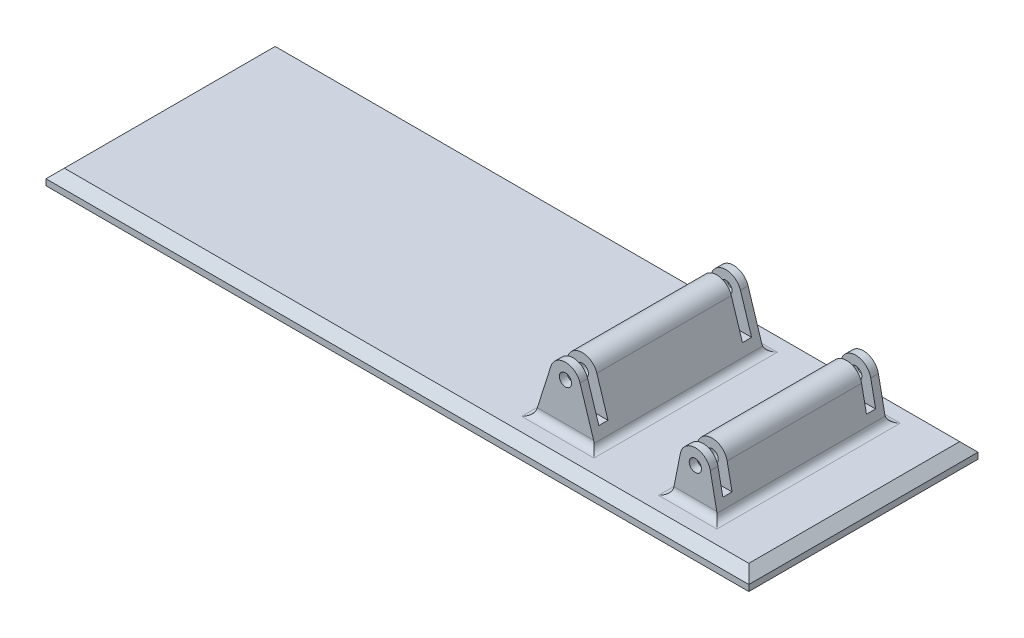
from build123d import *

# Parameters (mm, degrees)
SKETCH1_W                = 584.2
SKETCH1_H                = 190.5
SKETCH1_W_2              = 50.8
SKETCH1_H_2              = 139.7
SKETCH1_W_3              = 38.1
BASE_DEPTH               = 12.7
EDGE_CHAMFER_SIZE        = 7.62
MOUNTING_BOSS_DEPTH      = 69.85
MOUNTING_BOSS_DEPTH_BACK = 69.85
SKETCH2_R                = 12.7
MOUNTING_FILLET_R        = 6.35
SKETCH3_W                = 7.62
SKETCH3_H                = 38.1
SUPPORT_CUT_DEPTH        = 312.409075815
PIN_CUT_DEPTH            = 312.409075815
PIN_CUT_DEPTH_BACK       = 312.409075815
SKETCH4_R                = 5.08


with BuildPart() as part:
    # Sketch1 → Base (new body)
    # profile 1 of 3: a face of its own
    with BuildSketch(Plane(origin=(0, 0, 0), x_dir=(1, 0, 0), z_dir=(0, 1, 0))):
        Rectangle(SKETCH1_W, SKETCH1_H)
        with Locations((114.3, 0)):
            Rectangle(SKETCH1_W_2, SKETCH1_H_2, mode=Mode.SUBTRACT)
    # profile 2 of 3: a face of its own
    with BuildSketch(Plane(origin=(0, 0, 0), x_dir=(1, 0, 0), z_dir=(0, 1, 0))):
        with Locations((114.3, 0)):
            Rectangle(SKETCH1_W_2, SKETCH1_H_2)
    # profile 3 of 3: a face of its own
    with BuildSketch(Plane(origin=(0, 0, 0), x_dir=(1, 0, 0), z_dir=(0, 1, 0))):
        with Locations((222.25, 0)):
            Rectangle(SKETCH1_W_3, SKETCH1_H_2)
    extrude(amount=-BASE_DEPTH)

    # Edge Chamfer
    edge_chamfer_edges = [part.edges().sort_by_distance(p)[0] for p in [
        (-292.1, 0, 0),
        (0, 0, -95.25),
        (292.1, 0, 0),
        (0, 0, 95.25),
    ]]
    chamfer(edge_chamfer_edges, length=EDGE_CHAMFER_SIZE)

    # Sketch2 → Mounting Boss (add, two sides: drawn at the far end of the back side and taken through both)
    with BuildSketch(Plane.XY.offset(-MOUNTING_BOSS_DEPTH_BACK)):
        with BuildLine():
            Line((114.3, 0), (114.3, 25.4))
            ThreePointArc((114.3, 25.4), (104.052392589, 30.598230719), (102.19367142, 41.937552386))
            Line((102.19367142, 41.937552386), (88.9, 0))
            Line((88.9, 0), (114.3, 0))
        make_face()
        with BuildLine():
            ThreePointArc((127, 38.1), (123.280256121, 29.119743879), (114.3, 25.4))
            Line((114.3, 25.4), (114.3, 0))
            Line((114.3, 0), (139.7, 0))
            Line((139.7, 0), (126.40632858, 41.937552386))
            ThreePointArc((126.40632858, 41.937552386), (126.850704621, 40.041600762), (127, 38.1))
        make_face()
        with BuildLine():
            ThreePointArc((126.40632858, 41.937552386), (121.801769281, 48.347607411), (114.3, 50.8))
            Line((114.3, 50.8), (114.3, 25.4))
            ThreePointArc((114.3, 25.4), (123.280256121, 29.119743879), (127, 38.1))
            ThreePointArc((127, 38.1), (126.850704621, 40.041600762), (126.40632858, 41.937552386))
        make_face()
        with BuildLine():
            Line((114.3, 25.4), (114.3, 50.8))
            ThreePointArc((114.3, 50.8), (106.798230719, 48.347607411), (102.19367142, 41.937552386))
            ThreePointArc((102.19367142, 41.937552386), (104.052392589, 30.598230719), (114.3, 25.4))
        make_face()
        with BuildLine():
            ThreePointArc((126.40632858, 41.937552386), (121.801769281, 48.347607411), (114.3, 50.8))
            Line((114.3, 50.8), (114.3, 25.4))
            ThreePointArc((114.3, 25.4), (123.280256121, 29.119743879), (127, 38.1))
            ThreePointArc((127, 38.1), (126.850704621, 40.041600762), (126.40632858, 41.937552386))
        make_face()
        with BuildLine():
            Line((114.3, 25.4), (114.3, 50.8))
            ThreePointArc((114.3, 50.8), (106.798230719, 48.347607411), (102.19367142, 41.937552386))
            ThreePointArc((102.19367142, 41.937552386), (104.052392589, 30.598230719), (114.3, 25.4))
        make_face()
        with BuildLine():
            ThreePointArc((234.95, 30.48), (220.998113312, 17.841852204), (209.796806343, 32.971579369))
            Line((209.796806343, 32.971579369), (203.2, 0))
            Line((203.2, 0), (241.3, 0))
            Line((241.3, 0), (234.703193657, 32.971579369))
            ThreePointArc((234.703193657, 32.971579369), (234.888147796, 31.731886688), (234.95, 30.48))
        make_face()
        with Locations((222.25, 30.48)):
            Circle(SKETCH2_R)
    extrude(amount=MOUNTING_BOSS_DEPTH + MOUNTING_BOSS_DEPTH_BACK)

    # Mounting Fillet
    mounting_fillet_edges = [part.edges().sort_by_distance(p)[0] for p in [
        (139.7, 0, 0),
        (114.3, 0, -69.85),
        (88.9, 0, 0),
        (114.3, 0, 69.85),
        (241.3, 0, 0),
        (222.25, 0, -69.85),
        (203.2, 0, 0),
        (222.25, 0, 69.85),
    ]]
    fillet(mounting_fillet_edges, radius=MOUNTING_FILLET_R)

    # Sketch3 → Support Cut (cut, through all)
    with BuildSketch(Plane(origin=(0, 0, 0), x_dir=(0, 0, -1), z_dir=(1, 0, 0))):
        with Locations((-59.69, 31.75)):
            Rectangle(SKETCH3_W, SKETCH3_H)
        with Locations((59.69, 31.75)):
            Rectangle(SKETCH3_W, SKETCH3_H)
    extrude(amount=SUPPORT_CUT_DEPTH, mode=Mode.SUBTRACT)

    # Sketch4 → Pin Cut (cut, two sides: drawn at the far end of the back side and taken through both)
    with BuildSketch(Plane.XY.offset(-PIN_CUT_DEPTH_BACK)):
        with Locations((114.3, 38.1)):
            Circle(SKETCH4_R)
        with Locations(Location((222.25, 30.48, 0), (0, 0, 90))):
            Circle(SKETCH4_R)
    extrude(amount=PIN_CUT_DEPTH + PIN_CUT_DEPTH_BACK, mode=Mode.SUBTRACT)


solid = part.part
